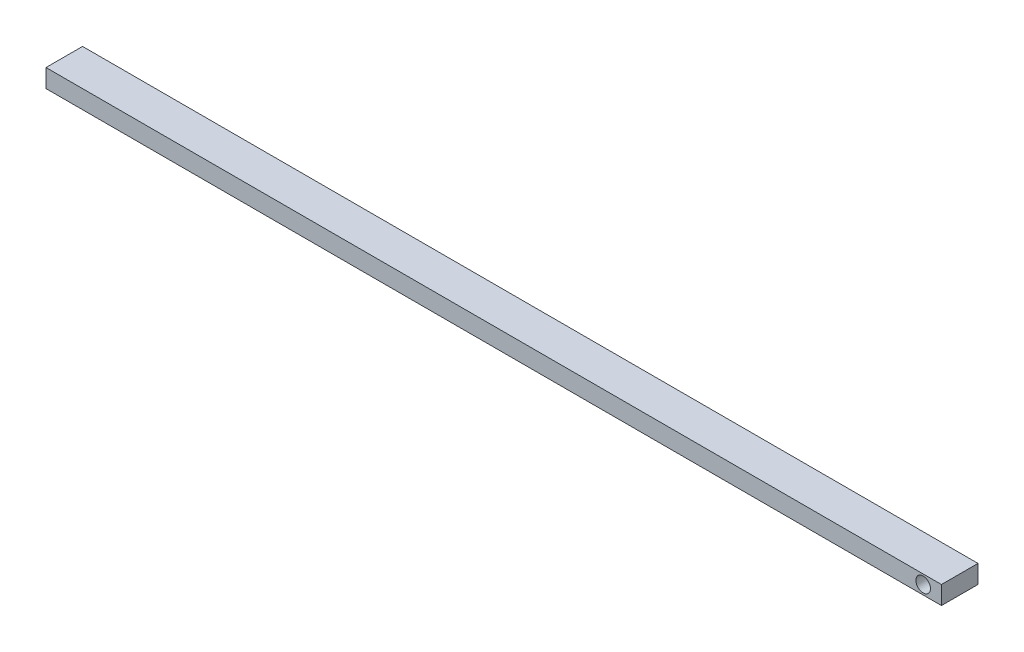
from build123d import *

# Parameters (mm, degrees)
SKIZZE1_W                       = 490
SKIZZE1_H                       = 10
AUFSATZ_LINEAR_AUSTRAGEN1_DEPTH = 20
SKIZZE2_R                       = 4
SCHNITT_LINEAR_AUSTRAGEN1_DEPTH = 491.509938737
SKIZZE3_R                       = 4.75
SCHNITT_LINEAR_AUSTRAGEN3_DEPTH = 400


with BuildPart() as part:
    # Skizze1 → Aufsatz-Linear austragen1 (new body)
    with BuildSketch(Plane.XY):
        with Locations((245, 5)):
            Rectangle(SKIZZE1_W, SKIZZE1_H)
    extrude(amount=AUFSATZ_LINEAR_AUSTRAGEN1_DEPTH)

    # Skizze2 → Schnitt-Linear austragen1 (cut, through all)
    with BuildSketch(Plane.XY.offset(20)):
        with Locations((480, 5)):
            Circle(SKIZZE2_R)
    extrude(amount=-SCHNITT_LINEAR_AUSTRAGEN1_DEPTH, mode=Mode.SUBTRACT)

    # Skizze3 → Schnitt-Linear austragen3 (cut)
    with BuildSketch(Plane.ZY):
        with Locations((10, 5)):
            Circle(SKIZZE3_R)
    extrude(amount=-SCHNITT_LINEAR_AUSTRAGEN3_DEPTH, mode=Mode.SUBTRACT)


solid = part.part
